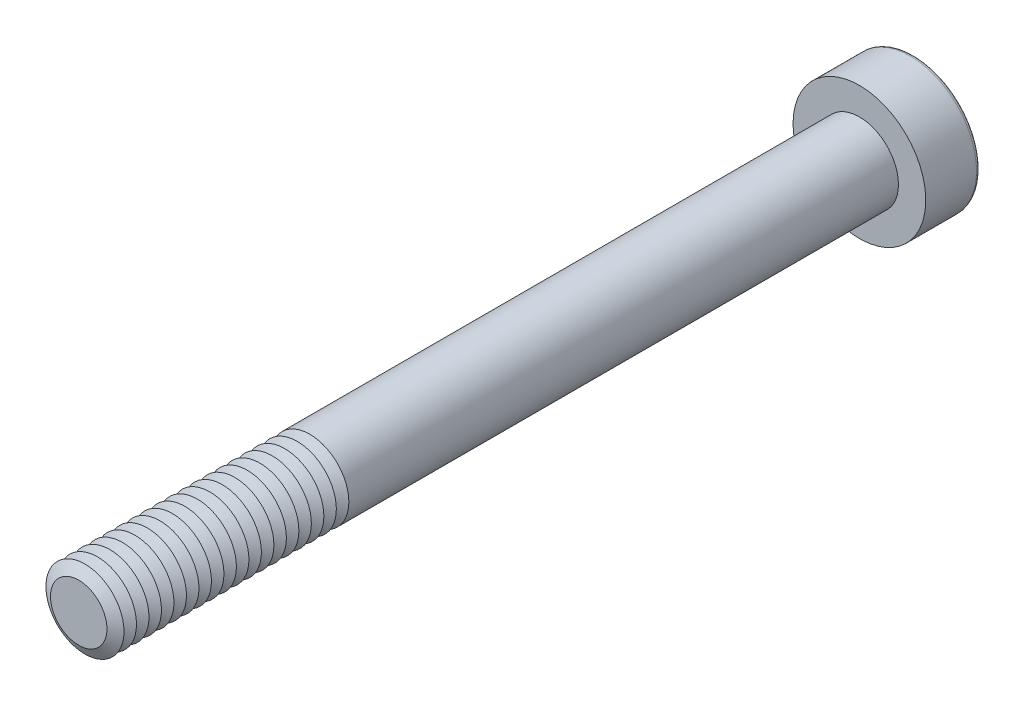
ISO-10303-21;
HEADER;
FILE_DESCRIPTION(('STEP AP214'),'2;1');
FILE_NAME('part.step','',(''),(''),'','','');
FILE_SCHEMA(('AUTOMOTIVE_DESIGN { 1 0 10303 214 1 1 1 1 }'));
ENDSEC;
DATA;
#1=APPLICATION_CONTEXT('core data for automotive mechanical design processes');
#2=APPLICATION_PROTOCOL_DEFINITION('international standard','automotive_design',2000,#1);
#3=PRODUCT_CONTEXT('',#1,'mechanical');
#4=PRODUCT('Part','Part','',(#3));
#5=PRODUCT_RELATED_PRODUCT_CATEGORY('part','',(#4));
#6=PRODUCT_DEFINITION_FORMATION('','',#4);
#7=PRODUCT_DEFINITION_CONTEXT('part definition',#1,'design');
#8=PRODUCT_DEFINITION('design','',#6,#7);
#9=PRODUCT_DEFINITION_SHAPE('','',#8);
#10=(LENGTH_UNIT() NAMED_UNIT(*) SI_UNIT(.MILLI.,.METRE.));
#11=(NAMED_UNIT(*) PLANE_ANGLE_UNIT() SI_UNIT($,.RADIAN.));
#12=(NAMED_UNIT(*) SI_UNIT($,.STERADIAN.) SOLID_ANGLE_UNIT());
#13=UNCERTAINTY_MEASURE_WITH_UNIT(LENGTH_MEASURE(1.E-05),#10,'distance_accuracy_value','');
#14=(GEOMETRIC_REPRESENTATION_CONTEXT(3) GLOBAL_UNCERTAINTY_ASSIGNED_CONTEXT((#13)) GLOBAL_UNIT_ASSIGNED_CONTEXT((#10,
#11,#12)) REPRESENTATION_CONTEXT('',''));
#15=CARTESIAN_POINT('',(0.,0.,0.));
#16=DIRECTION('',(0.,0.,1.));
#17=DIRECTION('',(1.,0.,0.));
#18=AXIS2_PLACEMENT_3D('',#15,#16,#17);
#19=CARTESIAN_POINT('',(0.,0.,47.2));
#20=DIRECTION('',(0.,0.,1.));
#21=DIRECTION('',(1.,0.,0.));
#22=AXIS2_PLACEMENT_3D('',#19,#20,#21);
#23=CONICAL_SURFACE('',#22,2.5,1.0471975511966);
#24=CARTESIAN_POINT('',(0.,0.,46.8));
#25=DIRECTION('',(0.,0.,1.));
#26=DIRECTION('',(1.,0.,0.));
#27=AXIS2_PLACEMENT_3D('',#24,#25,#26);
#28=CIRCLE('',#27,1.80717967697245);
#29=CARTESIAN_POINT('',(1.80717967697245,0.,46.8));
#30=VERTEX_POINT('',#29);
#31=EDGE_CURVE('E314',#30,#30,#28,.T.);
#32=ORIENTED_EDGE('',*,*,#31,.T.);
#33=EDGE_LOOP('',(#32));
#34=FACE_BOUND('',#33,.T.);
#35=CARTESIAN_POINT('',(0.,0.,47.2));
#36=DIRECTION('',(0.,0.,1.));
#37=DIRECTION('',(1.,0.,0.));
#38=AXIS2_PLACEMENT_3D('',#35,#36,#37);
#39=CIRCLE('',#38,2.5);
#40=CARTESIAN_POINT('',(2.5,0.,47.2));
#41=VERTEX_POINT('',#40);
#42=EDGE_CURVE('E317',#41,#41,#39,.T.);
#43=ORIENTED_EDGE('',*,*,#42,.F.);
#44=EDGE_LOOP('',(#43));
#45=FACE_BOUND('',#44,.T.);
#46=ADVANCED_FACE('F39',(#34,#45),#23,.T.);
#47=CARTESIAN_POINT('',(0.,0.,46.8));
#48=DIRECTION('',(0.,0.,-1.));
#49=DIRECTION('',(-1.,0.,0.));
#50=AXIS2_PLACEMENT_3D('',#47,#48,#49);
#51=CONICAL_SURFACE('',#50,1.80717967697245,1.04719755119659);
#52=CARTESIAN_POINT('',(0.,0.,46.4));
#53=DIRECTION('',(0.,0.,1.));
#54=DIRECTION('',(1.,0.,0.));
#55=AXIS2_PLACEMENT_3D('',#52,#53,#54);
#56=CIRCLE('',#55,2.5);
#57=CARTESIAN_POINT('',(2.5,0.,46.4));
#58=VERTEX_POINT('',#57);
#59=EDGE_CURVE('E325',#58,#58,#56,.T.);
#60=ORIENTED_EDGE('',*,*,#59,.T.);
#61=EDGE_LOOP('',(#60));
#62=FACE_BOUND('',#61,.T.);
#63=ORIENTED_EDGE('',*,*,#31,.F.);
#64=EDGE_LOOP('',(#63));
#65=FACE_BOUND('',#64,.T.);
#66=ADVANCED_FACE('F245',(#62,#65),#51,.T.);
#67=CARTESIAN_POINT('',(0.,0.,50.));
#68=DIRECTION('',(0.,0.,1.));
#69=DIRECTION('',(1.,0.,0.));
#70=AXIS2_PLACEMENT_3D('',#67,#68,#69);
#71=PLANE('',#70);
#72=CARTESIAN_POINT('',(0.,0.,50.));
#73=DIRECTION('',(0.,0.,1.));
#74=DIRECTION('',(1.,0.,0.));
#75=AXIS2_PLACEMENT_3D('',#72,#73,#74);
#76=CIRCLE('',#75,1.80717967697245);
#77=CARTESIAN_POINT('',(1.80717967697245,0.,50.));
#78=VERTEX_POINT('',#77);
#79=EDGE_CURVE('E174',#78,#78,#76,.T.);
#80=ORIENTED_EDGE('',*,*,#79,.T.);
#81=EDGE_LOOP('',(#80));
#82=FACE_BOUND('',#81,.T.);
#83=ADVANCED_FACE('F251',(#82),#71,.T.);
#84=CARTESIAN_POINT('',(0.,0.,50.));
#85=DIRECTION('',(0.,0.,-1.));
#86=DIRECTION('',(-1.,0.,0.));
#87=AXIS2_PLACEMENT_3D('',#84,#85,#86);
#88=CONICAL_SURFACE('',#87,1.80717967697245,1.04719755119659);
#89=CARTESIAN_POINT('',(0.,0.,49.6));
#90=DIRECTION('',(0.,0.,1.));
#91=DIRECTION('',(1.,0.,0.));
#92=AXIS2_PLACEMENT_3D('',#89,#90,#91);
#93=CIRCLE('',#92,2.5);
#94=CARTESIAN_POINT('',(2.5,0.,49.6));
#95=VERTEX_POINT('',#94);
#96=EDGE_CURVE('E291',#95,#95,#93,.T.);
#97=ORIENTED_EDGE('',*,*,#96,.T.);
#98=EDGE_LOOP('',(#97));
#99=FACE_BOUND('',#98,.T.);
#100=ORIENTED_EDGE('',*,*,#79,.F.);
#101=EDGE_LOOP('',(#100));
#102=FACE_BOUND('',#101,.T.);
#103=ADVANCED_FACE('F199',(#99,#102),#88,.T.);
#104=CARTESIAN_POINT('',(0.,0.,49.6));
#105=DIRECTION('',(0.,0.,1.));
#106=DIRECTION('',(1.,0.,0.));
#107=AXIS2_PLACEMENT_3D('',#104,#105,#106);
#108=CONICAL_SURFACE('',#107,2.5,1.0471975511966);
#109=CARTESIAN_POINT('',(0.,0.,49.2));
#110=DIRECTION('',(0.,0.,1.));
#111=DIRECTION('',(1.,0.,0.));
#112=AXIS2_PLACEMENT_3D('',#109,#110,#111);
#113=CIRCLE('',#112,1.80717967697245);
#114=CARTESIAN_POINT('',(1.80717967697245,0.,49.2));
#115=VERTEX_POINT('',#114);
#116=EDGE_CURVE('E288',#115,#115,#113,.T.);
#117=ORIENTED_EDGE('',*,*,#116,.T.);
#118=EDGE_LOOP('',(#117));
#119=FACE_BOUND('',#118,.T.);
#120=ORIENTED_EDGE('',*,*,#96,.F.);
#121=EDGE_LOOP('',(#120));
#122=FACE_BOUND('',#121,.T.);
#123=ADVANCED_FACE('F277',(#119,#122),#108,.T.);
#124=CARTESIAN_POINT('',(0.,0.,49.2));
#125=DIRECTION('',(0.,0.,-1.));
#126=DIRECTION('',(-1.,0.,0.));
#127=AXIS2_PLACEMENT_3D('',#124,#125,#126);
#128=CONICAL_SURFACE('',#127,1.80717967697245,1.04719755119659);
#129=CARTESIAN_POINT('',(0.,0.,48.8));
#130=DIRECTION('',(0.,0.,1.));
#131=DIRECTION('',(1.,0.,0.));
#132=AXIS2_PLACEMENT_3D('',#129,#130,#131);
#133=CIRCLE('',#132,2.5);
#134=CARTESIAN_POINT('',(2.5,0.,48.8));
#135=VERTEX_POINT('',#134);
#136=EDGE_CURVE('E300',#135,#135,#133,.T.);
#137=ORIENTED_EDGE('',*,*,#136,.T.);
#138=EDGE_LOOP('',(#137));
#139=FACE_BOUND('',#138,.T.);
#140=ORIENTED_EDGE('',*,*,#116,.F.);
#141=EDGE_LOOP('',(#140));
#142=FACE_BOUND('',#141,.T.);
#143=ADVANCED_FACE('F274',(#139,#142),#128,.T.);
#144=CARTESIAN_POINT('',(0.,0.,48.8));
#145=DIRECTION('',(0.,0.,1.));
#146=DIRECTION('',(1.,0.,0.));
#147=AXIS2_PLACEMENT_3D('',#144,#145,#146);
#148=CONICAL_SURFACE('',#147,2.5,1.0471975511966);
#149=CARTESIAN_POINT('',(0.,0.,48.4));
#150=DIRECTION('',(0.,0.,1.));
#151=DIRECTION('',(1.,0.,0.));
#152=AXIS2_PLACEMENT_3D('',#149,#150,#151);
#153=CIRCLE('',#152,1.80717967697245);
#154=CARTESIAN_POINT('',(1.80717967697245,0.,48.4));
#155=VERTEX_POINT('',#154);
#156=EDGE_CURVE('E293',#155,#155,#153,.T.);
#157=ORIENTED_EDGE('',*,*,#156,.T.);
#158=EDGE_LOOP('',(#157));
#159=FACE_BOUND('',#158,.T.);
#160=ORIENTED_EDGE('',*,*,#136,.F.);
#161=EDGE_LOOP('',(#160));
#162=FACE_BOUND('',#161,.T.);
#163=ADVANCED_FACE('F270',(#159,#162),#148,.T.);
#164=CARTESIAN_POINT('',(0.,0.,48.4));
#165=DIRECTION('',(0.,0.,-1.));
#166=DIRECTION('',(-1.,0.,0.));
#167=AXIS2_PLACEMENT_3D('',#164,#165,#166);
#168=CONICAL_SURFACE('',#167,1.80717967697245,1.04719755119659);
#169=CARTESIAN_POINT('',(0.,0.,48.));
#170=DIRECTION('',(0.,0.,1.));
#171=DIRECTION('',(1.,0.,0.));
#172=AXIS2_PLACEMENT_3D('',#169,#170,#171);
#173=CIRCLE('',#172,2.5);
#174=CARTESIAN_POINT('',(2.5,0.,48.));
#175=VERTEX_POINT('',#174);
#176=EDGE_CURVE('E310',#175,#175,#173,.T.);
#177=ORIENTED_EDGE('',*,*,#176,.T.);
#178=EDGE_LOOP('',(#177));
#179=FACE_BOUND('',#178,.T.);
#180=ORIENTED_EDGE('',*,*,#156,.F.);
#181=EDGE_LOOP('',(#180));
#182=FACE_BOUND('',#181,.T.);
#183=ADVANCED_FACE('F266',(#179,#182),#168,.T.);
#184=CARTESIAN_POINT('',(0.,0.,48.));
#185=DIRECTION('',(0.,0.,1.));
#186=DIRECTION('',(1.,0.,0.));
#187=AXIS2_PLACEMENT_3D('',#184,#185,#186);
#188=CONICAL_SURFACE('',#187,2.5,1.0471975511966);
#189=CARTESIAN_POINT('',(0.,0.,47.6));
#190=DIRECTION('',(0.,0.,1.));
#191=DIRECTION('',(1.,0.,0.));
#192=AXIS2_PLACEMENT_3D('',#189,#190,#191);
#193=CIRCLE('',#192,1.80717967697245);
#194=CARTESIAN_POINT('',(1.80717967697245,0.,47.6));
#195=VERTEX_POINT('',#194);
#196=EDGE_CURVE('E306',#195,#195,#193,.T.);
#197=ORIENTED_EDGE('',*,*,#196,.T.);
#198=EDGE_LOOP('',(#197));
#199=FACE_BOUND('',#198,.T.);
#200=ORIENTED_EDGE('',*,*,#176,.F.);
#201=EDGE_LOOP('',(#200));
#202=FACE_BOUND('',#201,.T.);
#203=ADVANCED_FACE('F262',(#199,#202),#188,.T.);
#204=CARTESIAN_POINT('',(0.,0.,47.6));
#205=DIRECTION('',(0.,0.,-1.));
#206=DIRECTION('',(-1.,0.,0.));
#207=AXIS2_PLACEMENT_3D('',#204,#205,#206);
#208=CONICAL_SURFACE('',#207,1.80717967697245,1.04719755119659);
#209=ORIENTED_EDGE('',*,*,#42,.T.);
#210=EDGE_LOOP('',(#209));
#211=FACE_BOUND('',#210,.T.);
#212=ORIENTED_EDGE('',*,*,#196,.F.);
#213=EDGE_LOOP('',(#212));
#214=FACE_BOUND('',#213,.T.);
#215=ADVANCED_FACE('F258',(#211,#214),#208,.T.);
#216=CARTESIAN_POINT('',(0.,0.,46.4));
#217=DIRECTION('',(0.,0.,1.));
#218=DIRECTION('',(1.,0.,0.));
#219=AXIS2_PLACEMENT_3D('',#216,#217,#218);
#220=CONICAL_SURFACE('',#219,2.5,1.0471975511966);
#221=CARTESIAN_POINT('',(0.,0.,46.));
#222=DIRECTION('',(0.,0.,1.));
#223=DIRECTION('',(1.,0.,0.));
#224=AXIS2_PLACEMENT_3D('',#221,#222,#223);
#225=CIRCLE('',#224,1.80717967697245);
#226=CARTESIAN_POINT('',(1.80717967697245,0.,46.));
#227=VERTEX_POINT('',#226);
#228=EDGE_CURVE('E321',#227,#227,#225,.T.);
#229=ORIENTED_EDGE('',*,*,#228,.T.);
#230=EDGE_LOOP('',(#229));
#231=FACE_BOUND('',#230,.T.);
#232=ORIENTED_EDGE('',*,*,#59,.F.);
#233=EDGE_LOOP('',(#232));
#234=FACE_BOUND('',#233,.T.);
#235=ADVANCED_FACE('F261',(#231,#234),#220,.T.);
#236=CARTESIAN_POINT('',(0.,0.,46.));
#237=DIRECTION('',(0.,0.,-1.));
#238=DIRECTION('',(-1.,0.,0.));
#239=AXIS2_PLACEMENT_3D('',#236,#237,#238);
#240=CONICAL_SURFACE('',#239,1.80717967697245,1.04719755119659);
#241=CARTESIAN_POINT('',(0.,0.,45.6));
#242=DIRECTION('',(0.,0.,1.));
#243=DIRECTION('',(1.,0.,0.));
#244=AXIS2_PLACEMENT_3D('',#241,#242,#243);
#245=CIRCLE('',#244,2.5);
#246=CARTESIAN_POINT('',(2.5,0.,45.6));
#247=VERTEX_POINT('',#246);
#248=EDGE_CURVE('E333',#247,#247,#245,.T.);
#249=ORIENTED_EDGE('',*,*,#248,.T.);
#250=EDGE_LOOP('',(#249));
#251=FACE_BOUND('',#250,.T.);
#252=ORIENTED_EDGE('',*,*,#228,.F.);
#253=EDGE_LOOP('',(#252));
#254=FACE_BOUND('',#253,.T.);
#255=ADVANCED_FACE('F545',(#251,#254),#240,.T.);
#256=CARTESIAN_POINT('',(0.,0.,45.6));
#257=DIRECTION('',(0.,0.,1.));
#258=DIRECTION('',(1.,0.,0.));
#259=AXIS2_PLACEMENT_3D('',#256,#257,#258);
#260=CONICAL_SURFACE('',#259,2.5,1.0471975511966);
#261=CARTESIAN_POINT('',(0.,0.,45.2));
#262=DIRECTION('',(0.,0.,1.));
#263=DIRECTION('',(1.,0.,0.));
#264=AXIS2_PLACEMENT_3D('',#261,#262,#263);
#265=CIRCLE('',#264,1.80717967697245);
#266=CARTESIAN_POINT('',(1.80717967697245,0.,45.2));
#267=VERTEX_POINT('',#266);
#268=EDGE_CURVE('E329',#267,#267,#265,.T.);
#269=ORIENTED_EDGE('',*,*,#268,.T.);
#270=EDGE_LOOP('',(#269));
#271=FACE_BOUND('',#270,.T.);
#272=ORIENTED_EDGE('',*,*,#248,.F.);
#273=EDGE_LOOP('',(#272));
#274=FACE_BOUND('',#273,.T.);
#275=ADVANCED_FACE('F541',(#271,#274),#260,.T.);
#276=CARTESIAN_POINT('',(0.,0.,45.2));
#277=DIRECTION('',(0.,0.,-1.));
#278=DIRECTION('',(-1.,0.,0.));
#279=AXIS2_PLACEMENT_3D('',#276,#277,#278);
#280=CONICAL_SURFACE('',#279,1.80717967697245,1.04719755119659);
#281=CARTESIAN_POINT('',(0.,0.,44.8));
#282=DIRECTION('',(0.,0.,1.));
#283=DIRECTION('',(1.,0.,0.));
#284=AXIS2_PLACEMENT_3D('',#281,#282,#283);
#285=CIRCLE('',#284,2.5);
#286=CARTESIAN_POINT('',(2.5,0.,44.8));
#287=VERTEX_POINT('',#286);
#288=EDGE_CURVE('E341',#287,#287,#285,.T.);
#289=ORIENTED_EDGE('',*,*,#288,.T.);
#290=EDGE_LOOP('',(#289));
#291=FACE_BOUND('',#290,.T.);
#292=ORIENTED_EDGE('',*,*,#268,.F.);
#293=EDGE_LOOP('',(#292));
#294=FACE_BOUND('',#293,.T.);
#295=ADVANCED_FACE('F537',(#291,#294),#280,.T.);
#296=CARTESIAN_POINT('',(0.,0.,44.8));
#297=DIRECTION('',(0.,0.,1.));
#298=DIRECTION('',(1.,0.,0.));
#299=AXIS2_PLACEMENT_3D('',#296,#297,#298);
#300=CONICAL_SURFACE('',#299,2.5,1.0471975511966);
#301=CARTESIAN_POINT('',(0.,0.,44.4));
#302=DIRECTION('',(0.,0.,1.));
#303=DIRECTION('',(1.,0.,0.));
#304=AXIS2_PLACEMENT_3D('',#301,#302,#303);
#305=CIRCLE('',#304,1.80717967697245);
#306=CARTESIAN_POINT('',(1.80717967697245,0.,44.4));
#307=VERTEX_POINT('',#306);
#308=EDGE_CURVE('E337',#307,#307,#305,.T.);
#309=ORIENTED_EDGE('',*,*,#308,.T.);
#310=EDGE_LOOP('',(#309));
#311=FACE_BOUND('',#310,.T.);
#312=ORIENTED_EDGE('',*,*,#288,.F.);
#313=EDGE_LOOP('',(#312));
#314=FACE_BOUND('',#313,.T.);
#315=ADVANCED_FACE('F533',(#311,#314),#300,.T.);
#316=CARTESIAN_POINT('',(0.,0.,44.4));
#317=DIRECTION('',(0.,0.,-1.));
#318=DIRECTION('',(-1.,0.,0.));
#319=AXIS2_PLACEMENT_3D('',#316,#317,#318);
#320=CONICAL_SURFACE('',#319,1.80717967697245,1.04719755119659);
#321=CARTESIAN_POINT('',(0.,0.,44.));
#322=DIRECTION('',(0.,0.,1.));
#323=DIRECTION('',(1.,0.,0.));
#324=AXIS2_PLACEMENT_3D('',#321,#322,#323);
#325=CIRCLE('',#324,2.5);
#326=CARTESIAN_POINT('',(2.5,0.,44.));
#327=VERTEX_POINT('',#326);
#328=EDGE_CURVE('E349',#327,#327,#325,.T.);
#329=ORIENTED_EDGE('',*,*,#328,.T.);
#330=EDGE_LOOP('',(#329));
#331=FACE_BOUND('',#330,.T.);
#332=ORIENTED_EDGE('',*,*,#308,.F.);
#333=EDGE_LOOP('',(#332));
#334=FACE_BOUND('',#333,.T.);
#335=ADVANCED_FACE('F529',(#331,#334),#320,.T.);
#336=CARTESIAN_POINT('',(0.,0.,44.));
#337=DIRECTION('',(0.,0.,1.));
#338=DIRECTION('',(1.,0.,0.));
#339=AXIS2_PLACEMENT_3D('',#336,#337,#338);
#340=CONICAL_SURFACE('',#339,2.5,1.0471975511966);
#341=CARTESIAN_POINT('',(0.,0.,43.6));
#342=DIRECTION('',(0.,0.,1.));
#343=DIRECTION('',(1.,0.,0.));
#344=AXIS2_PLACEMENT_3D('',#341,#342,#343);
#345=CIRCLE('',#344,1.80717967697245);
#346=CARTESIAN_POINT('',(1.80717967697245,0.,43.6));
#347=VERTEX_POINT('',#346);
#348=EDGE_CURVE('E345',#347,#347,#345,.T.);
#349=ORIENTED_EDGE('',*,*,#348,.T.);
#350=EDGE_LOOP('',(#349));
#351=FACE_BOUND('',#350,.T.);
#352=ORIENTED_EDGE('',*,*,#328,.F.);
#353=EDGE_LOOP('',(#352));
#354=FACE_BOUND('',#353,.T.);
#355=ADVANCED_FACE('F525',(#351,#354),#340,.T.);
#356=CARTESIAN_POINT('',(0.,0.,43.6));
#357=DIRECTION('',(0.,0.,-1.));
#358=DIRECTION('',(-1.,0.,0.));
#359=AXIS2_PLACEMENT_3D('',#356,#357,#358);
#360=CONICAL_SURFACE('',#359,1.80717967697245,1.04719755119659);
#361=CARTESIAN_POINT('',(0.,0.,43.2));
#362=DIRECTION('',(0.,0.,1.));
#363=DIRECTION('',(1.,0.,0.));
#364=AXIS2_PLACEMENT_3D('',#361,#362,#363);
#365=CIRCLE('',#364,2.5);
#366=CARTESIAN_POINT('',(2.5,0.,43.2));
#367=VERTEX_POINT('',#366);
#368=EDGE_CURVE('E356',#367,#367,#365,.T.);
#369=ORIENTED_EDGE('',*,*,#368,.T.);
#370=EDGE_LOOP('',(#369));
#371=FACE_BOUND('',#370,.T.);
#372=ORIENTED_EDGE('',*,*,#348,.F.);
#373=EDGE_LOOP('',(#372));
#374=FACE_BOUND('',#373,.T.);
#375=ADVANCED_FACE('F521',(#371,#374),#360,.T.);
#376=CARTESIAN_POINT('',(0.,0.,43.2));
#377=DIRECTION('',(0.,0.,1.));
#378=DIRECTION('',(1.,0.,0.));
#379=AXIS2_PLACEMENT_3D('',#376,#377,#378);
#380=CONICAL_SURFACE('',#379,2.5,1.0471975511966);
#381=CARTESIAN_POINT('',(0.,0.,42.8));
#382=DIRECTION('',(0.,0.,1.));
#383=DIRECTION('',(1.,0.,0.));
#384=AXIS2_PLACEMENT_3D('',#381,#382,#383);
#385=CIRCLE('',#384,1.80717967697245);
#386=CARTESIAN_POINT('',(1.80717967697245,0.,42.8));
#387=VERTEX_POINT('',#386);
#388=EDGE_CURVE('E353',#387,#387,#385,.T.);
#389=ORIENTED_EDGE('',*,*,#388,.T.);
#390=EDGE_LOOP('',(#389));
#391=FACE_BOUND('',#390,.T.);
#392=ORIENTED_EDGE('',*,*,#368,.F.);
#393=EDGE_LOOP('',(#392));
#394=FACE_BOUND('',#393,.T.);
#395=ADVANCED_FACE('F517',(#391,#394),#380,.T.);
#396=CARTESIAN_POINT('',(0.,0.,42.8));
#397=DIRECTION('',(0.,0.,-1.));
#398=DIRECTION('',(-1.,0.,0.));
#399=AXIS2_PLACEMENT_3D('',#396,#397,#398);
#400=CONICAL_SURFACE('',#399,1.80717967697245,1.04719755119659);
#401=CARTESIAN_POINT('',(0.,0.,42.4));
#402=DIRECTION('',(0.,0.,1.));
#403=DIRECTION('',(1.,0.,0.));
#404=AXIS2_PLACEMENT_3D('',#401,#402,#403);
#405=CIRCLE('',#404,2.5);
#406=CARTESIAN_POINT('',(2.5,0.,42.4));
#407=VERTEX_POINT('',#406);
#408=EDGE_CURVE('E364',#407,#407,#405,.T.);
#409=ORIENTED_EDGE('',*,*,#408,.T.);
#410=EDGE_LOOP('',(#409));
#411=FACE_BOUND('',#410,.T.);
#412=ORIENTED_EDGE('',*,*,#388,.F.);
#413=EDGE_LOOP('',(#412));
#414=FACE_BOUND('',#413,.T.);
#415=ADVANCED_FACE('F513',(#411,#414),#400,.T.);
#416=CARTESIAN_POINT('',(0.,0.,42.4));
#417=DIRECTION('',(0.,0.,1.));
#418=DIRECTION('',(1.,0.,0.));
#419=AXIS2_PLACEMENT_3D('',#416,#417,#418);
#420=CONICAL_SURFACE('',#419,2.5,1.0471975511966);
#421=CARTESIAN_POINT('',(0.,0.,42.));
#422=DIRECTION('',(0.,0.,1.));
#423=DIRECTION('',(1.,0.,0.));
#424=AXIS2_PLACEMENT_3D('',#421,#422,#423);
#425=CIRCLE('',#424,1.80717967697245);
#426=CARTESIAN_POINT('',(1.80717967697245,0.,42.));
#427=VERTEX_POINT('',#426);
#428=EDGE_CURVE('E360',#427,#427,#425,.T.);
#429=ORIENTED_EDGE('',*,*,#428,.T.);
#430=EDGE_LOOP('',(#429));
#431=FACE_BOUND('',#430,.T.);
#432=ORIENTED_EDGE('',*,*,#408,.F.);
#433=EDGE_LOOP('',(#432));
#434=FACE_BOUND('',#433,.T.);
#435=ADVANCED_FACE('F509',(#431,#434),#420,.T.);
#436=CARTESIAN_POINT('',(0.,0.,42.));
#437=DIRECTION('',(0.,0.,-1.));
#438=DIRECTION('',(-1.,0.,0.));
#439=AXIS2_PLACEMENT_3D('',#436,#437,#438);
#440=CONICAL_SURFACE('',#439,1.80717967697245,1.04719755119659);
#441=CARTESIAN_POINT('',(0.,0.,41.6));
#442=DIRECTION('',(0.,0.,1.));
#443=DIRECTION('',(1.,0.,0.));
#444=AXIS2_PLACEMENT_3D('',#441,#442,#443);
#445=CIRCLE('',#444,2.5);
#446=CARTESIAN_POINT('',(2.5,0.,41.6));
#447=VERTEX_POINT('',#446);
#448=EDGE_CURVE('E372',#447,#447,#445,.T.);
#449=ORIENTED_EDGE('',*,*,#448,.T.);
#450=EDGE_LOOP('',(#449));
#451=FACE_BOUND('',#450,.T.);
#452=ORIENTED_EDGE('',*,*,#428,.F.);
#453=EDGE_LOOP('',(#452));
#454=FACE_BOUND('',#453,.T.);
#455=ADVANCED_FACE('F505',(#451,#454),#440,.T.);
#456=CARTESIAN_POINT('',(0.,0.,41.6));
#457=DIRECTION('',(0.,0.,1.));
#458=DIRECTION('',(1.,0.,0.));
#459=AXIS2_PLACEMENT_3D('',#456,#457,#458);
#460=CONICAL_SURFACE('',#459,2.5,1.0471975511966);
#461=CARTESIAN_POINT('',(0.,0.,41.2));
#462=DIRECTION('',(0.,0.,1.));
#463=DIRECTION('',(1.,0.,0.));
#464=AXIS2_PLACEMENT_3D('',#461,#462,#463);
#465=CIRCLE('',#464,1.80717967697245);
#466=CARTESIAN_POINT('',(1.80717967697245,0.,41.2));
#467=VERTEX_POINT('',#466);
#468=EDGE_CURVE('E368',#467,#467,#465,.T.);
#469=ORIENTED_EDGE('',*,*,#468,.T.);
#470=EDGE_LOOP('',(#469));
#471=FACE_BOUND('',#470,.T.);
#472=ORIENTED_EDGE('',*,*,#448,.F.);
#473=EDGE_LOOP('',(#472));
#474=FACE_BOUND('',#473,.T.);
#475=ADVANCED_FACE('F501',(#471,#474),#460,.T.);
#476=CARTESIAN_POINT('',(0.,0.,41.2));
#477=DIRECTION('',(0.,0.,-1.));
#478=DIRECTION('',(-1.,0.,0.));
#479=AXIS2_PLACEMENT_3D('',#476,#477,#478);
#480=CONICAL_SURFACE('',#479,1.80717967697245,1.04719755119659);
#481=CARTESIAN_POINT('',(0.,0.,40.8));
#482=DIRECTION('',(0.,0.,1.));
#483=DIRECTION('',(1.,0.,0.));
#484=AXIS2_PLACEMENT_3D('',#481,#482,#483);
#485=CIRCLE('',#484,2.5);
#486=CARTESIAN_POINT('',(2.5,0.,40.8));
#487=VERTEX_POINT('',#486);
#488=EDGE_CURVE('E380',#487,#487,#485,.T.);
#489=ORIENTED_EDGE('',*,*,#488,.T.);
#490=EDGE_LOOP('',(#489));
#491=FACE_BOUND('',#490,.T.);
#492=ORIENTED_EDGE('',*,*,#468,.F.);
#493=EDGE_LOOP('',(#492));
#494=FACE_BOUND('',#493,.T.);
#495=ADVANCED_FACE('F497',(#491,#494),#480,.T.);
#496=CARTESIAN_POINT('',(0.,0.,40.8));
#497=DIRECTION('',(0.,0.,1.));
#498=DIRECTION('',(1.,0.,0.));
#499=AXIS2_PLACEMENT_3D('',#496,#497,#498);
#500=CONICAL_SURFACE('',#499,2.5,1.0471975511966);
#501=CARTESIAN_POINT('',(0.,0.,40.4));
#502=DIRECTION('',(0.,0.,1.));
#503=DIRECTION('',(1.,0.,0.));
#504=AXIS2_PLACEMENT_3D('',#501,#502,#503);
#505=CIRCLE('',#504,1.80717967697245);
#506=CARTESIAN_POINT('',(1.80717967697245,0.,40.4));
#507=VERTEX_POINT('',#506);
#508=EDGE_CURVE('E376',#507,#507,#505,.T.);
#509=ORIENTED_EDGE('',*,*,#508,.T.);
#510=EDGE_LOOP('',(#509));
#511=FACE_BOUND('',#510,.T.);
#512=ORIENTED_EDGE('',*,*,#488,.F.);
#513=EDGE_LOOP('',(#512));
#514=FACE_BOUND('',#513,.T.);
#515=ADVANCED_FACE('F493',(#511,#514),#500,.T.);
#516=CARTESIAN_POINT('',(0.,0.,40.4));
#517=DIRECTION('',(0.,0.,-1.));
#518=DIRECTION('',(-1.,0.,0.));
#519=AXIS2_PLACEMENT_3D('',#516,#517,#518);
#520=CONICAL_SURFACE('',#519,1.80717967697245,1.04719755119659);
#521=CARTESIAN_POINT('',(0.,0.,40.));
#522=DIRECTION('',(0.,0.,1.));
#523=DIRECTION('',(1.,0.,0.));
#524=AXIS2_PLACEMENT_3D('',#521,#522,#523);
#525=CIRCLE('',#524,2.5);
#526=CARTESIAN_POINT('',(2.5,0.,40.));
#527=VERTEX_POINT('',#526);
#528=EDGE_CURVE('E388',#527,#527,#525,.T.);
#529=ORIENTED_EDGE('',*,*,#528,.T.);
#530=EDGE_LOOP('',(#529));
#531=FACE_BOUND('',#530,.T.);
#532=ORIENTED_EDGE('',*,*,#508,.F.);
#533=EDGE_LOOP('',(#532));
#534=FACE_BOUND('',#533,.T.);
#535=ADVANCED_FACE('F489',(#531,#534),#520,.T.);
#536=CARTESIAN_POINT('',(0.,0.,40.));
#537=DIRECTION('',(0.,0.,1.));
#538=DIRECTION('',(1.,0.,0.));
#539=AXIS2_PLACEMENT_3D('',#536,#537,#538);
#540=CONICAL_SURFACE('',#539,2.5,1.0471975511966);
#541=CARTESIAN_POINT('',(0.,0.,39.6));
#542=DIRECTION('',(0.,0.,1.));
#543=DIRECTION('',(1.,0.,0.));
#544=AXIS2_PLACEMENT_3D('',#541,#542,#543);
#545=CIRCLE('',#544,1.80717967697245);
#546=CARTESIAN_POINT('',(1.80717967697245,0.,39.6));
#547=VERTEX_POINT('',#546);
#548=EDGE_CURVE('E384',#547,#547,#545,.T.);
#549=ORIENTED_EDGE('',*,*,#548,.T.);
#550=EDGE_LOOP('',(#549));
#551=FACE_BOUND('',#550,.T.);
#552=ORIENTED_EDGE('',*,*,#528,.F.);
#553=EDGE_LOOP('',(#552));
#554=FACE_BOUND('',#553,.T.);
#555=ADVANCED_FACE('F485',(#551,#554),#540,.T.);
#556=CARTESIAN_POINT('',(0.,0.,39.6));
#557=DIRECTION('',(0.,0.,-1.));
#558=DIRECTION('',(-1.,0.,0.));
#559=AXIS2_PLACEMENT_3D('',#556,#557,#558);
#560=CONICAL_SURFACE('',#559,1.80717967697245,1.04719755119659);
#561=CARTESIAN_POINT('',(0.,0.,39.2));
#562=DIRECTION('',(0.,0.,1.));
#563=DIRECTION('',(1.,0.,0.));
#564=AXIS2_PLACEMENT_3D('',#561,#562,#563);
#565=CIRCLE('',#564,2.5);
#566=CARTESIAN_POINT('',(2.5,0.,39.2));
#567=VERTEX_POINT('',#566);
#568=EDGE_CURVE('E395',#567,#567,#565,.T.);
#569=ORIENTED_EDGE('',*,*,#568,.T.);
#570=EDGE_LOOP('',(#569));
#571=FACE_BOUND('',#570,.T.);
#572=ORIENTED_EDGE('',*,*,#548,.F.);
#573=EDGE_LOOP('',(#572));
#574=FACE_BOUND('',#573,.T.);
#575=ADVANCED_FACE('F481',(#571,#574),#560,.T.);
#576=CARTESIAN_POINT('',(0.,0.,39.2));
#577=DIRECTION('',(0.,0.,1.));
#578=DIRECTION('',(1.,0.,0.));
#579=AXIS2_PLACEMENT_3D('',#576,#577,#578);
#580=CONICAL_SURFACE('',#579,2.5,1.0471975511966);
#581=CARTESIAN_POINT('',(0.,0.,38.8));
#582=DIRECTION('',(0.,0.,1.));
#583=DIRECTION('',(1.,0.,0.));
#584=AXIS2_PLACEMENT_3D('',#581,#582,#583);
#585=CIRCLE('',#584,1.80717967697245);
#586=CARTESIAN_POINT('',(1.80717967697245,0.,38.8));
#587=VERTEX_POINT('',#586);
#588=EDGE_CURVE('E391',#587,#587,#585,.T.);
#589=ORIENTED_EDGE('',*,*,#588,.T.);
#590=EDGE_LOOP('',(#589));
#591=FACE_BOUND('',#590,.T.);
#592=ORIENTED_EDGE('',*,*,#568,.F.);
#593=EDGE_LOOP('',(#592));
#594=FACE_BOUND('',#593,.T.);
#595=ADVANCED_FACE('F477',(#591,#594),#580,.T.);
#596=CARTESIAN_POINT('',(0.,0.,38.8));
#597=DIRECTION('',(0.,0.,-1.));
#598=DIRECTION('',(-1.,0.,0.));
#599=AXIS2_PLACEMENT_3D('',#596,#597,#598);
#600=CONICAL_SURFACE('',#599,1.80717967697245,1.04719755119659);
#601=CARTESIAN_POINT('',(0.,0.,38.4));
#602=DIRECTION('',(0.,0.,1.));
#603=DIRECTION('',(1.,0.,0.));
#604=AXIS2_PLACEMENT_3D('',#601,#602,#603);
#605=CIRCLE('',#604,2.5);
#606=CARTESIAN_POINT('',(2.5,0.,38.4));
#607=VERTEX_POINT('',#606);
#608=EDGE_CURVE('E403',#607,#607,#605,.T.);
#609=ORIENTED_EDGE('',*,*,#608,.T.);
#610=EDGE_LOOP('',(#609));
#611=FACE_BOUND('',#610,.T.);
#612=ORIENTED_EDGE('',*,*,#588,.F.);
#613=EDGE_LOOP('',(#612));
#614=FACE_BOUND('',#613,.T.);
#615=ADVANCED_FACE('F473',(#611,#614),#600,.T.);
#616=CARTESIAN_POINT('',(0.,0.,38.4));
#617=DIRECTION('',(0.,0.,1.));
#618=DIRECTION('',(1.,0.,0.));
#619=AXIS2_PLACEMENT_3D('',#616,#617,#618);
#620=CONICAL_SURFACE('',#619,2.5,1.0471975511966);
#621=CARTESIAN_POINT('',(0.,0.,38.));
#622=DIRECTION('',(0.,0.,1.));
#623=DIRECTION('',(1.,0.,0.));
#624=AXIS2_PLACEMENT_3D('',#621,#622,#623);
#625=CIRCLE('',#624,1.80717967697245);
#626=CARTESIAN_POINT('',(1.80717967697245,0.,38.));
#627=VERTEX_POINT('',#626);
#628=EDGE_CURVE('E399',#627,#627,#625,.T.);
#629=ORIENTED_EDGE('',*,*,#628,.T.);
#630=EDGE_LOOP('',(#629));
#631=FACE_BOUND('',#630,.T.);
#632=ORIENTED_EDGE('',*,*,#608,.F.);
#633=EDGE_LOOP('',(#632));
#634=FACE_BOUND('',#633,.T.);
#635=ADVANCED_FACE('F469',(#631,#634),#620,.T.);
#636=CARTESIAN_POINT('',(0.,0.,38.));
#637=DIRECTION('',(0.,0.,-1.));
#638=DIRECTION('',(-1.,0.,0.));
#639=AXIS2_PLACEMENT_3D('',#636,#637,#638);
#640=CONICAL_SURFACE('',#639,1.80717967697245,1.04719755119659);
#641=CARTESIAN_POINT('',(0.,0.,37.6));
#642=DIRECTION('',(0.,0.,1.));
#643=DIRECTION('',(1.,0.,0.));
#644=AXIS2_PLACEMENT_3D('',#641,#642,#643);
#645=CIRCLE('',#644,2.5);
#646=CARTESIAN_POINT('',(2.5,0.,37.6));
#647=VERTEX_POINT('',#646);
#648=EDGE_CURVE('E411',#647,#647,#645,.T.);
#649=ORIENTED_EDGE('',*,*,#648,.T.);
#650=EDGE_LOOP('',(#649));
#651=FACE_BOUND('',#650,.T.);
#652=ORIENTED_EDGE('',*,*,#628,.F.);
#653=EDGE_LOOP('',(#652));
#654=FACE_BOUND('',#653,.T.);
#655=ADVANCED_FACE('F465',(#651,#654),#640,.T.);
#656=CARTESIAN_POINT('',(0.,0.,37.6));
#657=DIRECTION('',(0.,0.,1.));
#658=DIRECTION('',(1.,0.,0.));
#659=AXIS2_PLACEMENT_3D('',#656,#657,#658);
#660=CONICAL_SURFACE('',#659,2.5,1.0471975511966);
#661=CARTESIAN_POINT('',(0.,0.,37.2));
#662=DIRECTION('',(0.,0.,1.));
#663=DIRECTION('',(1.,0.,0.));
#664=AXIS2_PLACEMENT_3D('',#661,#662,#663);
#665=CIRCLE('',#664,1.80717967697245);
#666=CARTESIAN_POINT('',(1.80717967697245,0.,37.2));
#667=VERTEX_POINT('',#666);
#668=EDGE_CURVE('E407',#667,#667,#665,.T.);
#669=ORIENTED_EDGE('',*,*,#668,.T.);
#670=EDGE_LOOP('',(#669));
#671=FACE_BOUND('',#670,.T.);
#672=ORIENTED_EDGE('',*,*,#648,.F.);
#673=EDGE_LOOP('',(#672));
#674=FACE_BOUND('',#673,.T.);
#675=ADVANCED_FACE('F461',(#671,#674),#660,.T.);
#676=CARTESIAN_POINT('',(0.,0.,37.2));
#677=DIRECTION('',(0.,0.,-1.));
#678=DIRECTION('',(-1.,0.,0.));
#679=AXIS2_PLACEMENT_3D('',#676,#677,#678);
#680=CONICAL_SURFACE('',#679,1.80717967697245,1.04719755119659);
#681=CARTESIAN_POINT('',(0.,0.,36.8));
#682=DIRECTION('',(0.,0.,1.));
#683=DIRECTION('',(1.,0.,0.));
#684=AXIS2_PLACEMENT_3D('',#681,#682,#683);
#685=CIRCLE('',#684,2.5);
#686=CARTESIAN_POINT('',(2.5,0.,36.8));
#687=VERTEX_POINT('',#686);
#688=EDGE_CURVE('E419',#687,#687,#685,.T.);
#689=ORIENTED_EDGE('',*,*,#688,.T.);
#690=EDGE_LOOP('',(#689));
#691=FACE_BOUND('',#690,.T.);
#692=ORIENTED_EDGE('',*,*,#668,.F.);
#693=EDGE_LOOP('',(#692));
#694=FACE_BOUND('',#693,.T.);
#695=ADVANCED_FACE('F457',(#691,#694),#680,.T.);
#696=CARTESIAN_POINT('',(0.,0.,36.8));
#697=DIRECTION('',(0.,0.,1.));
#698=DIRECTION('',(1.,0.,0.));
#699=AXIS2_PLACEMENT_3D('',#696,#697,#698);
#700=CONICAL_SURFACE('',#699,2.5,1.0471975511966);
#701=CARTESIAN_POINT('',(0.,0.,36.4));
#702=DIRECTION('',(0.,0.,1.));
#703=DIRECTION('',(1.,0.,0.));
#704=AXIS2_PLACEMENT_3D('',#701,#702,#703);
#705=CIRCLE('',#704,1.80717967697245);
#706=CARTESIAN_POINT('',(1.80717967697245,0.,36.4));
#707=VERTEX_POINT('',#706);
#708=EDGE_CURVE('E415',#707,#707,#705,.T.);
#709=ORIENTED_EDGE('',*,*,#708,.T.);
#710=EDGE_LOOP('',(#709));
#711=FACE_BOUND('',#710,.T.);
#712=ORIENTED_EDGE('',*,*,#688,.F.);
#713=EDGE_LOOP('',(#712));
#714=FACE_BOUND('',#713,.T.);
#715=ADVANCED_FACE('F452',(#711,#714),#700,.T.);
#716=CARTESIAN_POINT('',(0.,0.,36.4));
#717=DIRECTION('',(0.,0.,-1.));
#718=DIRECTION('',(-1.,0.,0.));
#719=AXIS2_PLACEMENT_3D('',#716,#717,#718);
#720=CONICAL_SURFACE('',#719,1.80717967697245,1.04719755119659);
#721=CARTESIAN_POINT('',(0.,0.,36.));
#722=DIRECTION('',(0.,0.,1.));
#723=DIRECTION('',(1.,0.,0.));
#724=AXIS2_PLACEMENT_3D('',#721,#722,#723);
#725=CIRCLE('',#724,2.5);
#726=CARTESIAN_POINT('',(2.5,0.,36.));
#727=VERTEX_POINT('',#726);
#728=EDGE_CURVE('E431',#727,#727,#725,.T.);
#729=ORIENTED_EDGE('',*,*,#728,.T.);
#730=EDGE_LOOP('',(#729));
#731=FACE_BOUND('',#730,.T.);
#732=ORIENTED_EDGE('',*,*,#708,.F.);
#733=EDGE_LOOP('',(#732));
#734=FACE_BOUND('',#733,.T.);
#735=ADVANCED_FACE('F438',(#731,#734),#720,.T.);
#736=CARTESIAN_POINT('',(0.,0.,36.));
#737=DIRECTION('',(0.,0.,1.));
#738=DIRECTION('',(1.,0.,0.));
#739=AXIS2_PLACEMENT_3D('',#736,#737,#738);
#740=CONICAL_SURFACE('',#739,2.5,1.0471975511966);
#741=CARTESIAN_POINT('',(0.,0.,35.6));
#742=DIRECTION('',(0.,0.,1.));
#743=DIRECTION('',(1.,0.,0.));
#744=AXIS2_PLACEMENT_3D('',#741,#742,#743);
#745=CIRCLE('',#744,1.80717967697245);
#746=CARTESIAN_POINT('',(1.80717967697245,0.,35.6));
#747=VERTEX_POINT('',#746);
#748=EDGE_CURVE('E423',#747,#747,#745,.T.);
#749=ORIENTED_EDGE('',*,*,#748,.T.);
#750=EDGE_LOOP('',(#749));
#751=FACE_BOUND('',#750,.T.);
#752=ORIENTED_EDGE('',*,*,#728,.F.);
#753=EDGE_LOOP('',(#752));
#754=FACE_BOUND('',#753,.T.);
#755=ADVANCED_FACE('F441',(#751,#754),#740,.T.);
#756=CARTESIAN_POINT('',(0.,0.,35.6));
#757=DIRECTION('',(0.,0.,-1.));
#758=DIRECTION('',(-1.,0.,0.));
#759=AXIS2_PLACEMENT_3D('',#756,#757,#758);
#760=CONICAL_SURFACE('',#759,1.80717967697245,1.04719755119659);
#761=CARTESIAN_POINT('',(0.,0.,35.2));
#762=DIRECTION('',(0.,0.,1.));
#763=DIRECTION('',(1.,0.,0.));
#764=AXIS2_PLACEMENT_3D('',#761,#762,#763);
#765=CIRCLE('',#764,2.5);
#766=CARTESIAN_POINT('',(2.5,0.,35.2));
#767=VERTEX_POINT('',#766);
#768=EDGE_CURVE('E427',#767,#767,#765,.T.);
#769=ORIENTED_EDGE('',*,*,#768,.T.);
#770=EDGE_LOOP('',(#769));
#771=FACE_BOUND('',#770,.T.);
#772=ORIENTED_EDGE('',*,*,#748,.F.);
#773=EDGE_LOOP('',(#772));
#774=FACE_BOUND('',#773,.T.);
#775=ADVANCED_FACE('F443',(#771,#774),#760,.T.);
#776=CARTESIAN_POINT('',(0.,0.,-1.25));
#777=DIRECTION('',(0.,0.,-1.));
#778=DIRECTION('',(-1.,0.,0.));
#779=AXIS2_PLACEMENT_3D('',#776,#777,#778);
#780=CONICAL_SURFACE('',#779,1.5,1.0471975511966);
#781=CARTESIAN_POINT('',(0.,0.,-0.383974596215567));
#782=VERTEX_POINT('',#781);
#783=VERTEX_LOOP('',#782);
#784=FACE_BOUND('',#783,.T.);
#785=CARTESIAN_POINT('',(0.,0.,-1.25));
#786=DIRECTION('',(0.,0.,-1.));
#787=DIRECTION('',(-1.,0.,0.));
#788=AXIS2_PLACEMENT_3D('',#785,#786,#787);
#789=CIRCLE('',#788,1.5);
#790=CARTESIAN_POINT('',(-1.29903810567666,0.749999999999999,-1.25));
#791=VERTEX_POINT('',#790);
#792=CARTESIAN_POINT('',(0.,1.5,-1.25));
#793=VERTEX_POINT('',#792);
#794=EDGE_CURVE('E149',#791,#793,#789,.T.);
#795=ORIENTED_EDGE('',*,*,#794,.T.);
#796=CARTESIAN_POINT('',(0.,0.,-1.25));
#797=DIRECTION('',(0.,0.,-1.));
#798=DIRECTION('',(-1.,0.,0.));
#799=AXIS2_PLACEMENT_3D('',#796,#797,#798);
#800=CIRCLE('',#799,1.5);
#801=CARTESIAN_POINT('',(1.29903810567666,0.75,-1.25));
#802=VERTEX_POINT('',#801);
#803=EDGE_CURVE('E54',#793,#802,#800,.T.);
#804=ORIENTED_EDGE('',*,*,#803,.T.);
#805=CARTESIAN_POINT('',(1.29903810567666,-0.75,-1.25));
#806=VERTEX_POINT('',#805);
#807=EDGE_CURVE('E1085',#802,#806,#800,.T.);
#808=ORIENTED_EDGE('',*,*,#807,.T.);
#809=CARTESIAN_POINT('',(0.,-1.5,-1.25));
#810=VERTEX_POINT('',#809);
#811=EDGE_CURVE('E1083',#806,#810,#800,.T.);
#812=ORIENTED_EDGE('',*,*,#811,.T.);
#813=CARTESIAN_POINT('',(-1.29903810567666,-0.749999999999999,-1.25));
#814=VERTEX_POINT('',#813);
#815=EDGE_CURVE('E1078',#810,#814,#800,.T.);
#816=ORIENTED_EDGE('',*,*,#815,.T.);
#817=EDGE_CURVE('E1076',#814,#791,#800,.T.);
#818=ORIENTED_EDGE('',*,*,#817,.T.);
#819=EDGE_LOOP('',(#795,#804,#808,#812,#816,#818));
#820=FACE_BOUND('',#819,.T.);
#821=ADVANCED_FACE('F201',(#784,#820),#780,.F.);
#822=CARTESIAN_POINT('',(0.,0.,-1.25));
#823=DIRECTION('',(0.,0.,-1.));
#824=DIRECTION('',(-1.,0.,0.));
#825=AXIS2_PLACEMENT_3D('',#822,#823,#824);
#826=PLANE('',#825);
#827=ORIENTED_EDGE('',*,*,#803,.F.);
#828=DIRECTION('',(1.,0.,0.));
#829=VECTOR('',#828,1.);
#830=CARTESIAN_POINT('',(-0.866025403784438,1.5,-1.25));
#831=LINE('',#830,#829);
#832=CARTESIAN_POINT('',(0.86602540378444,1.5,-1.25));
#833=VERTEX_POINT('',#832);
#834=EDGE_CURVE('E1125',#793,#833,#831,.T.);
#835=ORIENTED_EDGE('',*,*,#834,.T.);
#836=DIRECTION('',(0.5,-0.866025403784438,0.));
#837=VECTOR('',#836,1.);
#838=CARTESIAN_POINT('',(0.86602540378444,1.5,-1.25));
#839=LINE('',#838,#837);
#840=EDGE_CURVE('E155',#833,#802,#839,.T.);
#841=ORIENTED_EDGE('',*,*,#840,.T.);
#842=EDGE_LOOP('',(#827,#835,#841));
#843=FACE_BOUND('',#842,.T.);
#844=ADVANCED_FACE('F652',(#843),#826,.T.);
#845=ORIENTED_EDGE('',*,*,#807,.F.);
#846=CARTESIAN_POINT('',(1.73205080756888,0.,-1.25));
#847=VERTEX_POINT('',#846);
#848=EDGE_CURVE('E1126',#802,#847,#839,.T.);
#849=ORIENTED_EDGE('',*,*,#848,.T.);
#850=DIRECTION('',(-0.5,-0.866025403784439,0.));
#851=VECTOR('',#850,1.);
#852=CARTESIAN_POINT('',(1.73205080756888,0.,-1.25));
#853=LINE('',#852,#851);
#854=EDGE_CURVE('E1100',#847,#806,#853,.T.);
#855=ORIENTED_EDGE('',*,*,#854,.T.);
#856=EDGE_LOOP('',(#845,#849,#855));
#857=FACE_BOUND('',#856,.T.);
#858=ADVANCED_FACE('F662',(#857),#826,.T.);
#859=ORIENTED_EDGE('',*,*,#811,.F.);
#860=CARTESIAN_POINT('',(0.86602540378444,-1.5,-1.25));
#861=VERTEX_POINT('',#860);
#862=EDGE_CURVE('E1102',#806,#861,#853,.T.);
#863=ORIENTED_EDGE('',*,*,#862,.T.);
#864=DIRECTION('',(-1.,0.,0.));
#865=VECTOR('',#864,1.);
#866=CARTESIAN_POINT('',(0.86602540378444,-1.5,-1.25));
#867=LINE('',#866,#865);
#868=EDGE_CURVE('E1052',#861,#810,#867,.T.);
#869=ORIENTED_EDGE('',*,*,#868,.T.);
#870=EDGE_LOOP('',(#859,#863,#869));
#871=FACE_BOUND('',#870,.T.);
#872=ADVANCED_FACE('F672',(#871),#826,.T.);
#873=ORIENTED_EDGE('',*,*,#815,.F.);
#874=CARTESIAN_POINT('',(-0.866025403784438,-1.5,-1.25));
#875=VERTEX_POINT('',#874);
#876=EDGE_CURVE('E1096',#810,#875,#867,.T.);
#877=ORIENTED_EDGE('',*,*,#876,.T.);
#878=DIRECTION('',(-0.5,0.866025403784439,0.));
#879=VECTOR('',#878,1.);
#880=CARTESIAN_POINT('',(-0.866025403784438,-1.5,-1.25));
#881=LINE('',#880,#879);
#882=EDGE_CURVE('E1098',#875,#814,#881,.T.);
#883=ORIENTED_EDGE('',*,*,#882,.T.);
#884=EDGE_LOOP('',(#873,#877,#883));
#885=FACE_BOUND('',#884,.T.);
#886=ADVANCED_FACE('F680',(#885),#826,.T.);
#887=ORIENTED_EDGE('',*,*,#817,.F.);
#888=CARTESIAN_POINT('',(-1.73205080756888,0.,-1.25));
#889=VERTEX_POINT('',#888);
#890=EDGE_CURVE('E1104',#814,#889,#881,.T.);
#891=ORIENTED_EDGE('',*,*,#890,.T.);
#892=DIRECTION('',(0.5,0.866025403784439,0.));
#893=VECTOR('',#892,1.);
#894=CARTESIAN_POINT('',(-1.73205080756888,0.,-1.25));
#895=LINE('',#894,#893);
#896=EDGE_CURVE('E158',#889,#791,#895,.T.);
#897=ORIENTED_EDGE('',*,*,#896,.T.);
#898=EDGE_LOOP('',(#887,#891,#897));
#899=FACE_BOUND('',#898,.T.);
#900=ADVANCED_FACE('F231',(#899),#826,.T.);
#901=ORIENTED_EDGE('',*,*,#794,.F.);
#902=CARTESIAN_POINT('',(-0.866025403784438,1.5,-1.25));
#903=VERTEX_POINT('',#902);
#904=EDGE_CURVE('E1111',#791,#903,#895,.T.);
#905=ORIENTED_EDGE('',*,*,#904,.T.);
#906=EDGE_CURVE('E1124',#903,#793,#831,.T.);
#907=ORIENTED_EDGE('',*,*,#906,.T.);
#908=EDGE_LOOP('',(#901,#905,#907));
#909=FACE_BOUND('',#908,.T.);
#910=ADVANCED_FACE('F664',(#909),#826,.T.);
#911=CARTESIAN_POINT('',(-0.866025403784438,1.5,-1.25));
#912=DIRECTION('',(0.,1.,0.));
#913=DIRECTION('',(-1.,0.,0.));
#914=AXIS2_PLACEMENT_3D('',#911,#912,#913);
#915=PLANE('',#914);
#916=DIRECTION('',(0.,0.,-1.));
#917=VECTOR('',#916,1.);
#918=CARTESIAN_POINT('',(-0.866025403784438,1.5,-1.25));
#919=LINE('',#918,#917);
#920=CARTESIAN_POINT('',(-0.866025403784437,1.5,-3.5));
#921=VERTEX_POINT('',#920);
#922=EDGE_CURVE('E147',#903,#921,#919,.T.);
#923=ORIENTED_EDGE('',*,*,#922,.T.);
#924=CARTESIAN_POINT('',(-2.26080568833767,1.5,-3.76288767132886));
#925=CARTESIAN_POINT('',(-2.19307335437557,1.5,-3.74776718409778));
#926=CARTESIAN_POINT('',(-2.12529797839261,1.5,-3.73283936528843));
#927=CARTESIAN_POINT('',(-1.989639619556,1.5,-3.7034664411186));
#928=CARTESIAN_POINT('',(-1.92175663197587,1.5,-3.6890213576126));
#929=CARTESIAN_POINT('',(-1.71778516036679,1.5,-3.6465295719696));
#930=CARTESIAN_POINT('',(-1.58151166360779,1.5,-3.61935744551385));
#931=CARTESIAN_POINT('',(-1.30947840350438,1.5,-3.56878855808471));
#932=CARTESIAN_POINT('',(-1.17372447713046,1.5,-3.54536102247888));
#933=CARTESIAN_POINT('',(-0.90140428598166,1.5,-3.50385032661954));
#934=CARTESIAN_POINT('',(-0.764838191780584,1.5,-3.48576608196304));
#935=CARTESIAN_POINT('',(-0.489293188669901,1.5,-3.45729203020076));
#936=CARTESIAN_POINT('',(-0.350304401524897,1.5,-3.44699084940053));
#937=CARTESIAN_POINT('',(-0.14157144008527,1.5,-3.43918165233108));
#938=CARTESIAN_POINT('',(-0.0719628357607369,1.5,-3.43785196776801));
#939=CARTESIAN_POINT('',(0.0672555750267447,1.5,-3.43779336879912));
#940=CARTESIAN_POINT('',(0.136865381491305,1.5,-3.43906445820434));
#941=CARTESIAN_POINT('',(0.346114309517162,1.5,-3.44672257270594));
#942=CARTESIAN_POINT('',(0.48561964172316,1.5,-3.45697478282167));
#943=CARTESIAN_POINT('',(0.76382969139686,1.5,-3.48560011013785));
#944=CARTESIAN_POINT('',(0.902533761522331,1.5,-3.50397905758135));
#945=CARTESIAN_POINT('',(1.18270277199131,1.5,-3.54677522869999));
#946=CARTESIAN_POINT('',(1.32414472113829,1.5,-3.57133816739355));
#947=CARTESIAN_POINT('',(1.60634089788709,1.5,-3.62417713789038));
#948=CARTESIAN_POINT('',(1.74709501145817,1.5,-3.65245376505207));
#949=CARTESIAN_POINT('',(2.02813527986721,1.5,-3.71141289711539));
#950=CARTESIAN_POINT('',(2.16842128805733,1.5,-3.74209609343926));
#951=CARTESIAN_POINT('',(2.44863558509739,1.5,-3.80505759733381));
#952=CARTESIAN_POINT('',(2.5885638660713,1.5,-3.8373359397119));
#953=CARTESIAN_POINT('',(2.86645602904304,1.5,-3.90258693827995));
#954=CARTESIAN_POINT('',(3.0044230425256,1.5,-3.93554631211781));
#955=CARTESIAN_POINT('',(3.28017563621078,1.5,-4.00222717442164));
#956=CARTESIAN_POINT('',(3.41796121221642,1.5,-4.03594868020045));
#957=CARTESIAN_POINT('',(3.69320305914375,1.5,-4.10389962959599));
#958=CARTESIAN_POINT('',(3.83065952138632,1.5,-4.13812829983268));
#959=CARTESIAN_POINT('',(4.10546119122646,1.5,-4.20700872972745));
#960=CARTESIAN_POINT('',(4.24280640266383,1.5,-4.2416604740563));
#961=CARTESIAN_POINT('',(4.38011382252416,1.5,-4.27645965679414));
#962=B_SPLINE_CURVE_WITH_KNOTS('',3,(#924,#925,#926,#927,#928,#929,#930,#931,#932,#933,#934,
#935,#936,#937,#938,#939,#940,#941,#942,#943,#944,#945,#946,#947,#948,#949,#950,#951,#952,#953,
#954,#955,#956,#957,#958,#959,#960,#961),.UNSPECIFIED.,.F.,.F.,(4,2,2,2,2,2,2,2,2,2,2,2,2,2,2,2,
2,2,4),(0.,0.208198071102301,0.416405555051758,0.833243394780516,1.2464565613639,
1.65958581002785,2.07735129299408,2.28617008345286,2.49498917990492,2.91428402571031,
3.33388016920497,3.76448033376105,4.19514961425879,4.62594308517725,5.05674596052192,
5.48229088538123,5.90784548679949,6.33280701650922,6.75775319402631),.UNSPECIFIED.);
#963=CARTESIAN_POINT('',(0.866025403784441,1.5,-3.5));
#964=VERTEX_POINT('',#963);
#965=EDGE_CURVE('E124',#921,#964,#962,.T.);
#966=ORIENTED_EDGE('',*,*,#965,.T.);
#967=DIRECTION('',(0.,0.,-1.));
#968=VECTOR('',#967,1.);
#969=CARTESIAN_POINT('',(0.86602540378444,1.5,-1.25));
#970=LINE('',#969,#968);
#971=EDGE_CURVE('E143',#833,#964,#970,.T.);
#972=ORIENTED_EDGE('',*,*,#971,.F.);
#973=ORIENTED_EDGE('',*,*,#834,.F.);
#974=ORIENTED_EDGE('',*,*,#906,.F.);
#975=EDGE_LOOP('',(#923,#966,#972,#973,#974));
#976=FACE_BOUND('',#975,.T.);
#977=ADVANCED_FACE('F141',(#976),#915,.F.);
#978=CARTESIAN_POINT('',(0.86602540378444,1.5,-1.25));
#979=DIRECTION('',(0.866025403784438,0.5,0.));
#980=DIRECTION('',(-0.5,0.866025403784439,0.));
#981=AXIS2_PLACEMENT_3D('',#978,#979,#980);
#982=PLANE('',#981);
#983=ORIENTED_EDGE('',*,*,#971,.T.);
#984=CARTESIAN_POINT('',(0.865909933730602,1.5002,-3.50003094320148));
#985=CARTESIAN_POINT('',(0.901883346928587,1.43789222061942,-3.49038632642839));
#986=CARTESIAN_POINT('',(0.937921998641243,1.37547144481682,-3.48163049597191));
#987=CARTESIAN_POINT('',(1.01012661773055,1.25040937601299,-3.46624719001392));
#988=CARTESIAN_POINT('',(1.04629263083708,1.18776800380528,-3.4596205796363));
#989=CARTESIAN_POINT('',(1.11853262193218,1.06264466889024,-3.44888268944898));
#990=CARTESIAN_POINT('',(1.15460611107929,1.00016355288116,-3.44475860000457));
#991=CARTESIAN_POINT('',(1.22679910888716,0.875121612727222,-3.43922860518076));
#992=CARTESIAN_POINT('',(1.26291860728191,0.812560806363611,-3.43782217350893));
#993=CARTESIAN_POINT('',(1.33515760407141,0.68743919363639,-3.43782217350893));
#994=CARTESIAN_POINT('',(1.37127710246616,0.62487838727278,-3.43922860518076));
#995=CARTESIAN_POINT('',(1.44347010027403,0.49983644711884,-3.44475860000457));
#996=CARTESIAN_POINT('',(1.47954358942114,0.437355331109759,-3.44888268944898));
#997=CARTESIAN_POINT('',(1.55178358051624,0.312231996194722,-3.4596205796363));
#998=CARTESIAN_POINT('',(1.58794959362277,0.249590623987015,-3.46624719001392));
#999=CARTESIAN_POINT('',(1.66015421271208,0.124528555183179,-3.48163049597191));
#1000=CARTESIAN_POINT('',(1.69619286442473,0.0621077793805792,-3.49038632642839));
#1001=CARTESIAN_POINT('',(1.73216627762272,-0.000199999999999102,-3.50003094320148));
#1002=B_SPLINE_CURVE_WITH_KNOTS('',3,(#984,#985,#986,#987,#988,#989,#990,#991,#992,#993,#994,
#995,#996,#997,#998,#999,#1000,#1001),.UNSPECIFIED.,.F.,.F.,(4,2,2,2,2,2,2,2,4),(0.,
0.217782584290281,0.435653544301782,0.652399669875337,0.869103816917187,1.08580796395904,
1.30255408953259,1.52042504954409,1.73820763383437),.UNSPECIFIED.);
#1003=CARTESIAN_POINT('',(1.73205080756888,0.,-3.5));
#1004=VERTEX_POINT('',#1003);
#1005=EDGE_CURVE('E11',#964,#1004,#1002,.T.);
#1006=ORIENTED_EDGE('',*,*,#1005,.T.);
#1007=DIRECTION('',(0.,0.,-1.));
#1008=VECTOR('',#1007,1.);
#1009=CARTESIAN_POINT('',(1.73205080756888,0.,-1.25));
#1010=LINE('',#1009,#1008);
#1011=EDGE_CURVE('E157',#847,#1004,#1010,.T.);
#1012=ORIENTED_EDGE('',*,*,#1011,.F.);
#1013=ORIENTED_EDGE('',*,*,#848,.F.);
#1014=ORIENTED_EDGE('',*,*,#840,.F.);
#1015=EDGE_LOOP('',(#983,#1006,#1012,#1013,#1014));
#1016=FACE_BOUND('',#1015,.T.);
#1017=ADVANCED_FACE('F152',(#1016),#982,.F.);
#1018=CARTESIAN_POINT('',(1.73205080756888,0.,-1.25));
#1019=DIRECTION('',(0.866025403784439,-0.5,0.));
#1020=DIRECTION('',(0.5,0.866025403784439,0.));
#1021=AXIS2_PLACEMENT_3D('',#1018,#1019,#1020);
#1022=PLANE('',#1021);
#1023=ORIENTED_EDGE('',*,*,#1011,.T.);
#1024=CARTESIAN_POINT('',(1.73216627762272,0.000200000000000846,-3.50003094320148));
#1025=CARTESIAN_POINT('',(1.69619286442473,-0.0621077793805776,-3.49038632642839));
#1026=CARTESIAN_POINT('',(1.66015421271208,-0.124528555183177,-3.48163049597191));
#1027=CARTESIAN_POINT('',(1.58794959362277,-0.249590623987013,-3.46624719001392));
#1028=CARTESIAN_POINT('',(1.55178358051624,-0.312231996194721,-3.4596205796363));
#1029=CARTESIAN_POINT('',(1.47954358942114,-0.437355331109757,-3.44888268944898));
#1030=CARTESIAN_POINT('',(1.44347010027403,-0.499836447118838,-3.44475860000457));
#1031=CARTESIAN_POINT('',(1.37127710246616,-0.624878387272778,-3.43922860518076));
#1032=CARTESIAN_POINT('',(1.33515760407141,-0.687439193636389,-3.43782217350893));
#1033=CARTESIAN_POINT('',(1.26291860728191,-0.81256080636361,-3.43782217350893));
#1034=CARTESIAN_POINT('',(1.22679910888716,-0.87512161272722,-3.43922860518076));
#1035=CARTESIAN_POINT('',(1.15460611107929,-1.00016355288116,-3.44475860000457));
#1036=CARTESIAN_POINT('',(1.11853262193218,-1.06264466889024,-3.44888268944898));
#1037=CARTESIAN_POINT('',(1.04629263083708,-1.18776800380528,-3.4596205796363));
#1038=CARTESIAN_POINT('',(1.01012661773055,-1.25040937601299,-3.46624719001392));
#1039=CARTESIAN_POINT('',(0.937921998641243,-1.37547144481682,-3.48163049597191));
#1040=CARTESIAN_POINT('',(0.901883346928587,-1.43789222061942,-3.49038632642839));
#1041=CARTESIAN_POINT('',(0.865909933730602,-1.5002,-3.50003094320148));
#1042=B_SPLINE_CURVE_WITH_KNOTS('',3,(#1024,#1025,#1026,#1027,#1028,#1029,#1030,#1031,#1032,
#1033,#1034,#1035,#1036,#1037,#1038,#1039,#1040,#1041),.UNSPECIFIED.,.F.,.F.,(4,2,2,2,2,2,2,2,
4),(0.,0.217782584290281,0.435653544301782,0.652399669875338,0.869103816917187,1.08580796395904,
1.30255408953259,1.52042504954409,1.73820763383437),.UNSPECIFIED.);
#1043=CARTESIAN_POINT('',(0.86602540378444,-1.5,-3.5));
#1044=VERTEX_POINT('',#1043);
#1045=EDGE_CURVE('E173',#1004,#1044,#1042,.T.);
#1046=ORIENTED_EDGE('',*,*,#1045,.T.);
#1047=DIRECTION('',(0.,0.,-1.));
#1048=VECTOR('',#1047,1.);
#1049=CARTESIAN_POINT('',(0.86602540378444,-1.5,-1.25));
#1050=LINE('',#1049,#1048);
#1051=EDGE_CURVE('E1047',#861,#1044,#1050,.T.);
#1052=ORIENTED_EDGE('',*,*,#1051,.F.);
#1053=ORIENTED_EDGE('',*,*,#862,.F.);
#1054=ORIENTED_EDGE('',*,*,#854,.F.);
#1055=EDGE_LOOP('',(#1023,#1046,#1052,#1053,#1054));
#1056=FACE_BOUND('',#1055,.T.);
#1057=ADVANCED_FACE('F191',(#1056),#1022,.F.);
#1058=CARTESIAN_POINT('',(0.86602540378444,-1.5,-1.25));
#1059=DIRECTION('',(0.,-1.,0.));
#1060=DIRECTION('',(0.,0.,-1.));
#1061=AXIS2_PLACEMENT_3D('',#1058,#1059,#1060);
#1062=PLANE('',#1061);
#1063=ORIENTED_EDGE('',*,*,#1051,.T.);
#1064=CARTESIAN_POINT('',(-2.26080568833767,-1.5,-3.76288767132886));
#1065=CARTESIAN_POINT('',(-2.19307335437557,-1.5,-3.74776718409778));
#1066=CARTESIAN_POINT('',(-2.12529797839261,-1.5,-3.73283936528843));
#1067=CARTESIAN_POINT('',(-1.989639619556,-1.5,-3.7034664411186));
#1068=CARTESIAN_POINT('',(-1.92175663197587,-1.5,-3.6890213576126));
#1069=CARTESIAN_POINT('',(-1.71778516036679,-1.5,-3.6465295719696));
#1070=CARTESIAN_POINT('',(-1.58151166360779,-1.5,-3.61935744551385));
#1071=CARTESIAN_POINT('',(-1.30947840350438,-1.5,-3.56878855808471));
#1072=CARTESIAN_POINT('',(-1.17372447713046,-1.5,-3.54536102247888));
#1073=CARTESIAN_POINT('',(-0.90140428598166,-1.5,-3.50385032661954));
#1074=CARTESIAN_POINT('',(-0.764838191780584,-1.5,-3.48576608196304));
#1075=CARTESIAN_POINT('',(-0.489293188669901,-1.5,-3.45729203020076));
#1076=CARTESIAN_POINT('',(-0.350304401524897,-1.5,-3.44699084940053));
#1077=CARTESIAN_POINT('',(-0.14157144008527,-1.5,-3.43918165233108));
#1078=CARTESIAN_POINT('',(-0.0719628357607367,-1.5,-3.43785196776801));
#1079=CARTESIAN_POINT('',(0.0672555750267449,-1.5,-3.43779336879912));
#1080=CARTESIAN_POINT('',(0.136865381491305,-1.5,-3.43906445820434));
#1081=CARTESIAN_POINT('',(0.346114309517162,-1.5,-3.44672257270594));
#1082=CARTESIAN_POINT('',(0.48561964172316,-1.5,-3.45697478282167));
#1083=CARTESIAN_POINT('',(0.76382969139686,-1.5,-3.48560011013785));
#1084=CARTESIAN_POINT('',(0.902533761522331,-1.5,-3.50397905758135));
#1085=CARTESIAN_POINT('',(1.18270277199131,-1.5,-3.54677522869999));
#1086=CARTESIAN_POINT('',(1.32414472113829,-1.5,-3.57133816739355));
#1087=CARTESIAN_POINT('',(1.60634089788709,-1.5,-3.62417713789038));
#1088=CARTESIAN_POINT('',(1.74709501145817,-1.5,-3.65245376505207));
#1089=CARTESIAN_POINT('',(2.02813527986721,-1.5,-3.71141289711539));
#1090=CARTESIAN_POINT('',(2.16842128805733,-1.5,-3.74209609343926));
#1091=CARTESIAN_POINT('',(2.44863558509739,-1.5,-3.80505759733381));
#1092=CARTESIAN_POINT('',(2.5885638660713,-1.5,-3.8373359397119));
#1093=CARTESIAN_POINT('',(2.86645602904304,-1.5,-3.90258693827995));
#1094=CARTESIAN_POINT('',(3.0044230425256,-1.5,-3.93554631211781));
#1095=CARTESIAN_POINT('',(3.28017563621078,-1.5,-4.00222717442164));
#1096=CARTESIAN_POINT('',(3.41796121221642,-1.5,-4.03594868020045));
#1097=CARTESIAN_POINT('',(3.69320305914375,-1.5,-4.10389962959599));
#1098=CARTESIAN_POINT('',(3.83065952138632,-1.5,-4.13812829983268));
#1099=CARTESIAN_POINT('',(4.10546119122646,-1.5,-4.20700872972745));
#1100=CARTESIAN_POINT('',(4.24280640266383,-1.5,-4.2416604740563));
#1101=CARTESIAN_POINT('',(4.38011382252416,-1.5,-4.27645965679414));
#1102=B_SPLINE_CURVE_WITH_KNOTS('',3,(#1064,#1065,#1066,#1067,#1068,#1069,#1070,#1071,#1072,
#1073,#1074,#1075,#1076,#1077,#1078,#1079,#1080,#1081,#1082,#1083,#1084,#1085,#1086,#1087,#1088,
#1089,#1090,#1091,#1092,#1093,#1094,#1095,#1096,#1097,#1098,#1099,#1100,#1101),.UNSPECIFIED.,
.F.,.F.,(4,2,2,2,2,2,2,2,2,2,2,2,2,2,2,2,2,2,4),(0.,0.208198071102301,0.416405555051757,
0.833243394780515,1.2464565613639,1.65958581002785,2.07735129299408,2.28617008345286,
2.49498917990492,2.91428402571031,3.33388016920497,3.76448033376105,4.19514961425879,
4.62594308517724,5.05674596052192,5.48229088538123,5.90784548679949,6.33280701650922,
6.75775319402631),.UNSPECIFIED.);
#1103=CARTESIAN_POINT('',(-0.866025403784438,-1.5,-3.5));
#1104=VERTEX_POINT('',#1103);
#1105=EDGE_CURVE('E184',#1044,#1104,#1102,.F.);
#1106=ORIENTED_EDGE('',*,*,#1105,.T.);
#1107=DIRECTION('',(0.,0.,-1.));
#1108=VECTOR('',#1107,1.);
#1109=CARTESIAN_POINT('',(-0.866025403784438,-1.5,-1.25));
#1110=LINE('',#1109,#1108);
#1111=EDGE_CURVE('E1054',#875,#1104,#1110,.T.);
#1112=ORIENTED_EDGE('',*,*,#1111,.F.);
#1113=ORIENTED_EDGE('',*,*,#876,.F.);
#1114=ORIENTED_EDGE('',*,*,#868,.F.);
#1115=EDGE_LOOP('',(#1063,#1106,#1112,#1113,#1114));
#1116=FACE_BOUND('',#1115,.T.);
#1117=ADVANCED_FACE('F234',(#1116),#1062,.F.);
#1118=CARTESIAN_POINT('',(-0.866025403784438,-1.5,-1.25));
#1119=DIRECTION('',(-0.866025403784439,-0.5,0.));
#1120=DIRECTION('',(0.5,-0.866025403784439,0.));
#1121=AXIS2_PLACEMENT_3D('',#1118,#1119,#1120);
#1122=PLANE('',#1121);
#1123=ORIENTED_EDGE('',*,*,#1111,.T.);
#1124=CARTESIAN_POINT('',(-0.8659099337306,-1.5002,-3.50003094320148));
#1125=CARTESIAN_POINT('',(-0.901883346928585,-1.43789222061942,-3.49038632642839));
#1126=CARTESIAN_POINT('',(-0.937921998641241,-1.37547144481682,-3.48163049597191));
#1127=CARTESIAN_POINT('',(-1.01012661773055,-1.25040937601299,-3.46624719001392));
#1128=CARTESIAN_POINT('',(-1.04629263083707,-1.18776800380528,-3.4596205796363));
#1129=CARTESIAN_POINT('',(-1.11853262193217,-1.06264466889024,-3.44888268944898));
#1130=CARTESIAN_POINT('',(-1.15460611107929,-1.00016355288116,-3.44475860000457));
#1131=CARTESIAN_POINT('',(-1.22679910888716,-0.875121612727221,-3.43922860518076));
#1132=CARTESIAN_POINT('',(-1.26291860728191,-0.81256080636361,-3.43782217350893));
#1133=CARTESIAN_POINT('',(-1.33515760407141,-0.68743919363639,-3.43782217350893));
#1134=CARTESIAN_POINT('',(-1.37127710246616,-0.624878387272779,-3.43922860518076));
#1135=CARTESIAN_POINT('',(-1.44347010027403,-0.499836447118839,-3.44475860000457));
#1136=CARTESIAN_POINT('',(-1.47954358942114,-0.437355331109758,-3.44888268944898));
#1137=CARTESIAN_POINT('',(-1.55178358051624,-0.312231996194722,-3.4596205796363));
#1138=CARTESIAN_POINT('',(-1.58794959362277,-0.249590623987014,-3.46624719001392));
#1139=CARTESIAN_POINT('',(-1.66015421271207,-0.124528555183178,-3.48163049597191));
#1140=CARTESIAN_POINT('',(-1.69619286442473,-0.0621077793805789,-3.49038632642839));
#1141=CARTESIAN_POINT('',(-1.73216627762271,0.000199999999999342,-3.50003094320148));
#1142=B_SPLINE_CURVE_WITH_KNOTS('',3,(#1124,#1125,#1126,#1127,#1128,#1129,#1130,#1131,#1132,
#1133,#1134,#1135,#1136,#1137,#1138,#1139,#1140,#1141),.UNSPECIFIED.,.F.,.F.,(4,2,2,2,2,2,2,2,
4),(0.,0.217782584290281,0.435653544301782,0.652399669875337,0.869103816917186,1.08580796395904,
1.30255408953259,1.52042504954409,1.73820763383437),.UNSPECIFIED.);
#1143=CARTESIAN_POINT('',(-1.73205080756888,0.,-3.5));
#1144=VERTEX_POINT('',#1143);
#1145=EDGE_CURVE('E208',#1104,#1144,#1142,.T.);
#1146=ORIENTED_EDGE('',*,*,#1145,.T.);
#1147=DIRECTION('',(0.,0.,-1.));
#1148=VECTOR('',#1147,1.);
#1149=CARTESIAN_POINT('',(-1.73205080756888,0.,-1.25));
#1150=LINE('',#1149,#1148);
#1151=EDGE_CURVE('E1057',#889,#1144,#1150,.T.);
#1152=ORIENTED_EDGE('',*,*,#1151,.F.);
#1153=ORIENTED_EDGE('',*,*,#890,.F.);
#1154=ORIENTED_EDGE('',*,*,#882,.F.);
#1155=EDGE_LOOP('',(#1123,#1146,#1152,#1153,#1154));
#1156=FACE_BOUND('',#1155,.T.);
#1157=ADVANCED_FACE('F229',(#1156),#1122,.F.);
#1158=CARTESIAN_POINT('',(-1.73205080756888,0.,-1.25));
#1159=DIRECTION('',(-0.866025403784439,0.5,0.));
#1160=DIRECTION('',(-0.5,-0.866025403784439,0.));
#1161=AXIS2_PLACEMENT_3D('',#1158,#1159,#1160);
#1162=PLANE('',#1161);
#1163=ORIENTED_EDGE('',*,*,#1151,.T.);
#1164=CARTESIAN_POINT('',(-1.73216627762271,-0.000200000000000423,-3.50003094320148));
#1165=CARTESIAN_POINT('',(-1.69619286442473,0.0621077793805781,-3.49038632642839));
#1166=CARTESIAN_POINT('',(-1.66015421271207,0.124528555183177,-3.48163049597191));
#1167=CARTESIAN_POINT('',(-1.58794959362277,0.249590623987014,-3.46624719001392));
#1168=CARTESIAN_POINT('',(-1.55178358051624,0.312231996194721,-3.4596205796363));
#1169=CARTESIAN_POINT('',(-1.47954358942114,0.437355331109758,-3.44888268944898));
#1170=CARTESIAN_POINT('',(-1.44347010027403,0.499836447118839,-3.44475860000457));
#1171=CARTESIAN_POINT('',(-1.37127710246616,0.624878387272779,-3.43922860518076));
#1172=CARTESIAN_POINT('',(-1.33515760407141,0.687439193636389,-3.43782217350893));
#1173=CARTESIAN_POINT('',(-1.26291860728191,0.81256080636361,-3.43782217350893));
#1174=CARTESIAN_POINT('',(-1.22679910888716,0.875121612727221,-3.43922860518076));
#1175=CARTESIAN_POINT('',(-1.15460611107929,1.00016355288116,-3.44475860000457));
#1176=CARTESIAN_POINT('',(-1.11853262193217,1.06264466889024,-3.44888268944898));
#1177=CARTESIAN_POINT('',(-1.04629263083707,1.18776800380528,-3.4596205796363));
#1178=CARTESIAN_POINT('',(-1.01012661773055,1.25040937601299,-3.46624719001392));
#1179=CARTESIAN_POINT('',(-0.937921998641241,1.37547144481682,-3.48163049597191));
#1180=CARTESIAN_POINT('',(-0.901883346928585,1.43789222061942,-3.49038632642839));
#1181=CARTESIAN_POINT('',(-0.8659099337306,1.5002,-3.50003094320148));
#1182=B_SPLINE_CURVE_WITH_KNOTS('',3,(#1164,#1165,#1166,#1167,#1168,#1169,#1170,#1171,#1172,
#1173,#1174,#1175,#1176,#1177,#1178,#1179,#1180,#1181),.UNSPECIFIED.,.F.,.F.,(4,2,2,2,2,2,2,2,
4),(0.,0.217782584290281,0.435653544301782,0.652399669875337,0.869103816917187,1.08580796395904,
1.30255408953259,1.52042504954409,1.73820763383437),.UNSPECIFIED.);
#1183=EDGE_CURVE('E150',#1144,#921,#1182,.T.);
#1184=ORIENTED_EDGE('',*,*,#1183,.T.);
#1185=ORIENTED_EDGE('',*,*,#922,.F.);
#1186=ORIENTED_EDGE('',*,*,#904,.F.);
#1187=ORIENTED_EDGE('',*,*,#896,.F.);
#1188=EDGE_LOOP('',(#1163,#1184,#1185,#1186,#1187));
#1189=FACE_BOUND('',#1188,.T.);
#1190=ADVANCED_FACE('F197',(#1189),#1162,.F.);
#1191=CARTESIAN_POINT('',(0.,0.,-3.5));
#1192=DIRECTION('',(0.,0.,-1.));
#1193=DIRECTION('',(-1.,0.,0.));
#1194=AXIS2_PLACEMENT_3D('',#1191,#1192,#1193);
#1195=CONICAL_SURFACE('',#1194,1.73205080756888,1.30899693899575);
#1196=CARTESIAN_POINT('',(0.,0.,-3.5));
#1197=DIRECTION('',(0.,0.,-1.));
#1198=DIRECTION('',(-1.,0.,0.));
#1199=AXIS2_PLACEMENT_3D('',#1196,#1197,#1198);
#1200=CIRCLE('',#1199,1.73205080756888);
#1201=EDGE_CURVE('E120',#921,#964,#1200,.T.);
#1202=ORIENTED_EDGE('',*,*,#1201,.T.);
#1203=ORIENTED_EDGE('',*,*,#965,.F.);
#1204=EDGE_LOOP('',(#1202,#1203));
#1205=FACE_BOUND('',#1204,.T.);
#1206=ADVANCED_FACE('F122',(#1205),#1195,.F.);
#1207=EDGE_CURVE('E129',#964,#1004,#1200,.T.);
#1208=ORIENTED_EDGE('',*,*,#1207,.T.);
#1209=ORIENTED_EDGE('',*,*,#1005,.F.);
#1210=EDGE_LOOP('',(#1208,#1209));
#1211=FACE_BOUND('',#1210,.T.);
#1212=ADVANCED_FACE('F133',(#1211),#1195,.F.);
#1213=EDGE_CURVE('E164',#1004,#1044,#1200,.T.);
#1214=ORIENTED_EDGE('',*,*,#1213,.T.);
#1215=ORIENTED_EDGE('',*,*,#1045,.F.);
#1216=EDGE_LOOP('',(#1214,#1215));
#1217=FACE_BOUND('',#1216,.T.);
#1218=ADVANCED_FACE('F745',(#1217),#1195,.F.);
#1219=EDGE_CURVE('E169',#1044,#1104,#1200,.T.);
#1220=ORIENTED_EDGE('',*,*,#1219,.T.);
#1221=ORIENTED_EDGE('',*,*,#1105,.F.);
#1222=EDGE_LOOP('',(#1220,#1221));
#1223=FACE_BOUND('',#1222,.T.);
#1224=ADVANCED_FACE('F752',(#1223),#1195,.F.);
#1225=EDGE_CURVE('E67',#1104,#1144,#1200,.T.);
#1226=ORIENTED_EDGE('',*,*,#1225,.T.);
#1227=ORIENTED_EDGE('',*,*,#1145,.F.);
#1228=EDGE_LOOP('',(#1226,#1227));
#1229=FACE_BOUND('',#1228,.T.);
#1230=ADVANCED_FACE('F760',(#1229),#1195,.F.);
#1231=EDGE_CURVE('E60',#1144,#921,#1200,.T.);
#1232=ORIENTED_EDGE('',*,*,#1231,.T.);
#1233=ORIENTED_EDGE('',*,*,#1183,.F.);
#1234=EDGE_LOOP('',(#1232,#1233));
#1235=FACE_BOUND('',#1234,.T.);
#1236=ADVANCED_FACE('F198',(#1235),#1195,.F.);
#1237=CARTESIAN_POINT('',(0.,0.,-3.5));
#1238=DIRECTION('',(0.,0.,-1.));
#1239=DIRECTION('',(-1.,0.,0.));
#1240=AXIS2_PLACEMENT_3D('',#1237,#1238,#1239);
#1241=PLANE('',#1240);
#1242=ORIENTED_EDGE('',*,*,#1231,.F.);
#1243=ORIENTED_EDGE('',*,*,#1225,.F.);
#1244=ORIENTED_EDGE('',*,*,#1219,.F.);
#1245=ORIENTED_EDGE('',*,*,#1213,.F.);
#1246=ORIENTED_EDGE('',*,*,#1207,.F.);
#1247=ORIENTED_EDGE('',*,*,#1201,.F.);
#1248=EDGE_LOOP('',(#1242,#1243,#1244,#1245,#1246,#1247));
#1249=FACE_BOUND('',#1248,.T.);
#1250=CARTESIAN_POINT('',(0.,0.,-3.5));
#1251=DIRECTION('',(0.,0.,-1.));
#1252=DIRECTION('',(-1.,0.,0.));
#1253=AXIS2_PLACEMENT_3D('',#1250,#1251,#1252);
#1254=CIRCLE('',#1253,4.);
#1255=CARTESIAN_POINT('',(-4.,0.,-3.5));
#1256=VERTEX_POINT('',#1255);
#1257=EDGE_CURVE('E1069',#1256,#1256,#1254,.T.);
#1258=ORIENTED_EDGE('',*,*,#1257,.T.);
#1259=EDGE_LOOP('',(#1258));
#1260=FACE_BOUND('',#1259,.T.);
#1261=ADVANCED_FACE('F161',(#1249,#1260),#1241,.T.);
#1262=CARTESIAN_POINT('',(0.,0.,-3.25));
#1263=DIRECTION('',(0.,0.,-1.));
#1264=DIRECTION('',(-1.,0.,0.));
#1265=AXIS2_PLACEMENT_3D('',#1262,#1263,#1264);
#1266=TOROIDAL_SURFACE('',#1265,4.,0.25);
#1267=CARTESIAN_POINT('',(0.,0.,-3.25));
#1268=DIRECTION('',(0.,0.,-1.));
#1269=DIRECTION('',(-1.,0.,0.));
#1270=AXIS2_PLACEMENT_3D('',#1267,#1268,#1269);
#1271=CIRCLE('',#1270,4.25);
#1272=CARTESIAN_POINT('',(-4.25,0.,-3.25));
#1273=VERTEX_POINT('',#1272);
#1274=EDGE_CURVE('E1073',#1273,#1273,#1271,.F.);
#1275=ORIENTED_EDGE('',*,*,#1274,.F.);
#1276=EDGE_LOOP('',(#1275));
#1277=FACE_BOUND('',#1276,.T.);
#1278=ORIENTED_EDGE('',*,*,#1257,.F.);
#1279=EDGE_LOOP('',(#1278));
#1280=FACE_BOUND('',#1279,.T.);
#1281=ADVANCED_FACE('F41',(#1277,#1280),#1266,.T.);
#1282=CARTESIAN_POINT('',(0.,0.,-3.5));
#1283=DIRECTION('',(0.,0.,1.));
#1284=DIRECTION('',(1.,0.,0.));
#1285=AXIS2_PLACEMENT_3D('',#1282,#1283,#1284);
#1286=CYLINDRICAL_SURFACE('',#1285,4.25);
#1287=ORIENTED_EDGE('',*,*,#1274,.T.);
#1288=EDGE_LOOP('',(#1287));
#1289=FACE_BOUND('',#1288,.T.);
#1290=CARTESIAN_POINT('',(0.,0.,0.));
#1291=DIRECTION('',(0.,0.,-1.));
#1292=DIRECTION('',(-1.,0.,0.));
#1293=AXIS2_PLACEMENT_3D('',#1290,#1291,#1292);
#1294=CIRCLE('',#1293,4.25);
#1295=CARTESIAN_POINT('',(-4.25,0.,0.));
#1296=VERTEX_POINT('',#1295);
#1297=EDGE_CURVE('E1063',#1296,#1296,#1294,.T.);
#1298=ORIENTED_EDGE('',*,*,#1297,.T.);
#1299=EDGE_LOOP('',(#1298));
#1300=FACE_BOUND('',#1299,.T.);
#1301=ADVANCED_FACE('F784',(#1289,#1300),#1286,.T.);
#1302=CARTESIAN_POINT('',(0.,0.,0.));
#1303=DIRECTION('',(0.,0.,-1.));
#1304=DIRECTION('',(-1.,0.,0.));
#1305=AXIS2_PLACEMENT_3D('',#1302,#1303,#1304);
#1306=PLANE('',#1305);
#1307=CARTESIAN_POINT('',(0.,0.,0.));
#1308=DIRECTION('',(0.,0.,1.));
#1309=DIRECTION('',(1.,0.,0.));
#1310=AXIS2_PLACEMENT_3D('',#1307,#1308,#1309);
#1311=CIRCLE('',#1310,2.5);
#1312=CARTESIAN_POINT('',(2.5,0.,0.));
#1313=VERTEX_POINT('',#1312);
#1314=EDGE_CURVE('E1066',#1313,#1313,#1311,.T.);
#1315=ORIENTED_EDGE('',*,*,#1314,.F.);
#1316=EDGE_LOOP('',(#1315));
#1317=FACE_BOUND('',#1316,.T.);
#1318=ORIENTED_EDGE('',*,*,#1297,.F.);
#1319=EDGE_LOOP('',(#1318));
#1320=FACE_BOUND('',#1319,.T.);
#1321=ADVANCED_FACE('F792',(#1317,#1320),#1306,.F.);
#1322=CARTESIAN_POINT('',(0.,0.,50.));
#1323=DIRECTION('',(0.,0.,-1.));
#1324=DIRECTION('',(-1.,0.,0.));
#1325=AXIS2_PLACEMENT_3D('',#1322,#1323,#1324);
#1326=CYLINDRICAL_SURFACE('',#1325,2.5);
#1327=ORIENTED_EDGE('',*,*,#1314,.T.);
#1328=EDGE_LOOP('',(#1327));
#1329=FACE_BOUND('',#1328,.T.);
#1330=ORIENTED_EDGE('',*,*,#768,.F.);
#1331=EDGE_LOOP('',(#1330));
#1332=FACE_BOUND('',#1331,.T.);
#1333=ADVANCED_FACE('F801',(#1329,#1332),#1326,.T.);
#1334=CLOSED_SHELL('',(#46,#66,#83,#103,#123,#143,#163,#183,#203,#215,#235,#255,#275,#295,#315,
#335,#355,#375,#395,#415,#435,#455,#475,#495,#515,#535,#555,#575,#595,#615,#635,#655,#675,#695,
#715,#735,#755,#775,#821,#844,#858,#872,#886,#900,#910,#977,#1017,#1057,#1117,#1157,#1190,#1206,
#1212,#1218,#1224,#1230,#1236,#1261,#1281,#1301,#1321,#1333));
#1335=MANIFOLD_SOLID_BREP('B2',#1334);
#1336=ADVANCED_BREP_SHAPE_REPRESENTATION('',(#18,#1335),#14);
#1337=SHAPE_DEFINITION_REPRESENTATION(#9,#1336);
ENDSEC;
END-ISO-10303-21;
